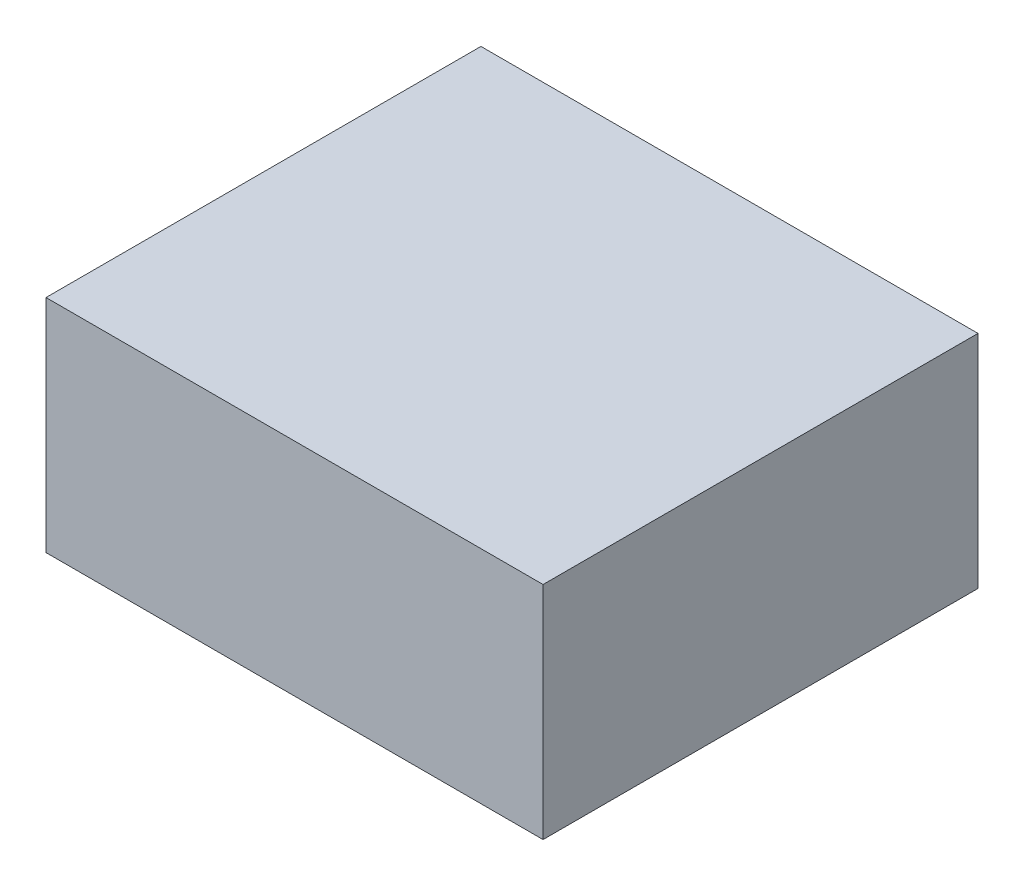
ISO-10303-21;
HEADER;
FILE_DESCRIPTION(('STEP AP214'),'2;1');
FILE_NAME('part.step','',(''),(''),'','','');
FILE_SCHEMA(('AUTOMOTIVE_DESIGN { 1 0 10303 214 1 1 1 1 }'));
ENDSEC;
DATA;
#1=APPLICATION_CONTEXT('core data for automotive mechanical design processes');
#2=APPLICATION_PROTOCOL_DEFINITION('international standard','automotive_design',2000,#1);
#3=PRODUCT_CONTEXT('',#1,'mechanical');
#4=PRODUCT('Part','Part','',(#3));
#5=PRODUCT_RELATED_PRODUCT_CATEGORY('part','',(#4));
#6=PRODUCT_DEFINITION_FORMATION('','',#4);
#7=PRODUCT_DEFINITION_CONTEXT('part definition',#1,'design');
#8=PRODUCT_DEFINITION('design','',#6,#7);
#9=PRODUCT_DEFINITION_SHAPE('','',#8);
#10=(LENGTH_UNIT() NAMED_UNIT(*) SI_UNIT(.MILLI.,.METRE.));
#11=(NAMED_UNIT(*) PLANE_ANGLE_UNIT() SI_UNIT($,.RADIAN.));
#12=(NAMED_UNIT(*) SI_UNIT($,.STERADIAN.) SOLID_ANGLE_UNIT());
#13=UNCERTAINTY_MEASURE_WITH_UNIT(LENGTH_MEASURE(1.E-05),#10,'distance_accuracy_value','');
#14=(GEOMETRIC_REPRESENTATION_CONTEXT(3) GLOBAL_UNCERTAINTY_ASSIGNED_CONTEXT((#13)) GLOBAL_UNIT_ASSIGNED_CONTEXT((#10,
#11,#12)) REPRESENTATION_CONTEXT('',''));
#15=CARTESIAN_POINT('',(0.,0.,0.));
#16=DIRECTION('',(0.,0.,1.));
#17=DIRECTION('',(1.,0.,0.));
#18=AXIS2_PLACEMENT_3D('',#15,#16,#17);
#19=CARTESIAN_POINT('',(18.,-61.,-15.75));
#20=DIRECTION('',(1.,0.,0.));
#21=DIRECTION('',(0.,0.,-1.));
#22=AXIS2_PLACEMENT_3D('',#19,#20,#21);
#23=PLANE('',#22);
#24=DIRECTION('',(0.,1.,0.));
#25=VECTOR('',#24,1.);
#26=CARTESIAN_POINT('',(18.,-61.,15.75));
#27=LINE('',#26,#25);
#28=CARTESIAN_POINT('',(18.,-61.,15.75));
#29=VERTEX_POINT('',#28);
#30=CARTESIAN_POINT('',(18.,-45.,15.75));
#31=VERTEX_POINT('',#30);
#32=EDGE_CURVE('E105',#29,#31,#27,.T.);
#33=ORIENTED_EDGE('',*,*,#32,.F.);
#34=DIRECTION('',(0.,0.,1.));
#35=VECTOR('',#34,1.);
#36=CARTESIAN_POINT('',(18.,-61.,-15.75));
#37=LINE('',#36,#35);
#38=CARTESIAN_POINT('',(18.,-61.,-15.75));
#39=VERTEX_POINT('',#38);
#40=EDGE_CURVE('E11',#39,#29,#37,.T.);
#41=ORIENTED_EDGE('',*,*,#40,.F.);
#42=DIRECTION('',(0.,1.,0.));
#43=VECTOR('',#42,1.);
#44=CARTESIAN_POINT('',(18.,-61.,-15.75));
#45=LINE('',#44,#43);
#46=CARTESIAN_POINT('',(18.,-45.,-15.75));
#47=VERTEX_POINT('',#46);
#48=EDGE_CURVE('E99',#39,#47,#45,.T.);
#49=ORIENTED_EDGE('',*,*,#48,.T.);
#50=DIRECTION('',(0.,0.,1.));
#51=VECTOR('',#50,1.);
#52=CARTESIAN_POINT('',(18.,-45.,-15.75));
#53=LINE('',#52,#51);
#54=EDGE_CURVE('E44',#47,#31,#53,.T.);
#55=ORIENTED_EDGE('',*,*,#54,.T.);
#56=EDGE_LOOP('',(#33,#41,#49,#55));
#57=FACE_BOUND('',#56,.T.);
#58=ADVANCED_FACE('F41',(#57),#23,.T.);
#59=CARTESIAN_POINT('',(-18.,-61.,-15.75));
#60=DIRECTION('',(0.,-1.,0.));
#61=DIRECTION('',(0.,0.,-1.));
#62=AXIS2_PLACEMENT_3D('',#59,#60,#61);
#63=PLANE('',#62);
#64=DIRECTION('',(1.,0.,0.));
#65=VECTOR('',#64,1.);
#66=CARTESIAN_POINT('',(-18.,-61.,15.75));
#67=LINE('',#66,#65);
#68=CARTESIAN_POINT('',(-18.,-61.,15.75));
#69=VERTEX_POINT('',#68);
#70=EDGE_CURVE('E101',#69,#29,#67,.T.);
#71=ORIENTED_EDGE('',*,*,#70,.F.);
#72=DIRECTION('',(0.,0.,1.));
#73=VECTOR('',#72,1.);
#74=CARTESIAN_POINT('',(-18.,-61.,-15.75));
#75=LINE('',#74,#73);
#76=CARTESIAN_POINT('',(-18.,-61.,-15.75));
#77=VERTEX_POINT('',#76);
#78=EDGE_CURVE('E50',#77,#69,#75,.T.);
#79=ORIENTED_EDGE('',*,*,#78,.F.);
#80=DIRECTION('',(1.,0.,0.));
#81=VECTOR('',#80,1.);
#82=CARTESIAN_POINT('',(-18.,-61.,-15.75));
#83=LINE('',#82,#81);
#84=EDGE_CURVE('E96',#77,#39,#83,.T.);
#85=ORIENTED_EDGE('',*,*,#84,.T.);
#86=ORIENTED_EDGE('',*,*,#40,.T.);
#87=EDGE_LOOP('',(#71,#79,#85,#86));
#88=FACE_BOUND('',#87,.T.);
#89=ADVANCED_FACE('F115',(#88),#63,.T.);
#90=CARTESIAN_POINT('',(-18.,-61.,-15.75));
#91=DIRECTION('',(-1.,0.,0.));
#92=DIRECTION('',(0.,0.,1.));
#93=AXIS2_PLACEMENT_3D('',#90,#91,#92);
#94=PLANE('',#93);
#95=DIRECTION('',(0.,-1.,0.));
#96=VECTOR('',#95,1.);
#97=CARTESIAN_POINT('',(-18.,-61.,15.75));
#98=LINE('',#97,#96);
#99=CARTESIAN_POINT('',(-18.,-45.,15.75));
#100=VERTEX_POINT('',#99);
#101=EDGE_CURVE('E91',#100,#69,#98,.T.);
#102=ORIENTED_EDGE('',*,*,#101,.F.);
#103=DIRECTION('',(0.,0.,1.));
#104=VECTOR('',#103,1.);
#105=CARTESIAN_POINT('',(-18.,-45.,-15.75));
#106=LINE('',#105,#104);
#107=CARTESIAN_POINT('',(-18.,-45.,-15.75));
#108=VERTEX_POINT('',#107);
#109=EDGE_CURVE('E86',#108,#100,#106,.T.);
#110=ORIENTED_EDGE('',*,*,#109,.F.);
#111=DIRECTION('',(0.,-1.,0.));
#112=VECTOR('',#111,1.);
#113=CARTESIAN_POINT('',(-18.,-61.,-15.75));
#114=LINE('',#113,#112);
#115=EDGE_CURVE('E89',#108,#77,#114,.T.);
#116=ORIENTED_EDGE('',*,*,#115,.T.);
#117=ORIENTED_EDGE('',*,*,#78,.T.);
#118=EDGE_LOOP('',(#102,#110,#116,#117));
#119=FACE_BOUND('',#118,.T.);
#120=ADVANCED_FACE('F88',(#119),#94,.T.);
#121=CARTESIAN_POINT('',(-18.,-45.,-15.75));
#122=DIRECTION('',(0.,1.,0.));
#123=DIRECTION('',(0.,0.,1.));
#124=AXIS2_PLACEMENT_3D('',#121,#122,#123);
#125=PLANE('',#124);
#126=DIRECTION('',(-1.,0.,0.));
#127=VECTOR('',#126,1.);
#128=CARTESIAN_POINT('',(-18.,-45.,15.75));
#129=LINE('',#128,#127);
#130=EDGE_CURVE('E108',#31,#100,#129,.T.);
#131=ORIENTED_EDGE('',*,*,#130,.F.);
#132=ORIENTED_EDGE('',*,*,#54,.F.);
#133=DIRECTION('',(-1.,0.,0.));
#134=VECTOR('',#133,1.);
#135=CARTESIAN_POINT('',(-18.,-45.,-15.75));
#136=LINE('',#135,#134);
#137=EDGE_CURVE('E95',#47,#108,#136,.T.);
#138=ORIENTED_EDGE('',*,*,#137,.T.);
#139=ORIENTED_EDGE('',*,*,#109,.T.);
#140=EDGE_LOOP('',(#131,#132,#138,#139));
#141=FACE_BOUND('',#140,.T.);
#142=ADVANCED_FACE('F98',(#141),#125,.T.);
#143=CARTESIAN_POINT('',(0.,0.,-15.75));
#144=DIRECTION('',(0.,0.,-1.));
#145=DIRECTION('',(-1.,0.,0.));
#146=AXIS2_PLACEMENT_3D('',#143,#144,#145);
#147=PLANE('',#146);
#148=ORIENTED_EDGE('',*,*,#48,.F.);
#149=ORIENTED_EDGE('',*,*,#84,.F.);
#150=ORIENTED_EDGE('',*,*,#115,.F.);
#151=ORIENTED_EDGE('',*,*,#137,.F.);
#152=EDGE_LOOP('',(#148,#149,#150,#151));
#153=FACE_BOUND('',#152,.T.);
#154=ADVANCED_FACE('F94',(#153),#147,.T.);
#155=CARTESIAN_POINT('',(0.,0.,15.75));
#156=DIRECTION('',(0.,0.,-1.));
#157=DIRECTION('',(-1.,0.,0.));
#158=AXIS2_PLACEMENT_3D('',#155,#156,#157);
#159=PLANE('',#158);
#160=ORIENTED_EDGE('',*,*,#32,.T.);
#161=ORIENTED_EDGE('',*,*,#130,.T.);
#162=ORIENTED_EDGE('',*,*,#101,.T.);
#163=ORIENTED_EDGE('',*,*,#70,.T.);
#164=EDGE_LOOP('',(#160,#161,#162,#163));
#165=FACE_BOUND('',#164,.T.);
#166=ADVANCED_FACE('F114',(#165),#159,.F.);
#167=CLOSED_SHELL('',(#58,#89,#120,#142,#154,#166));
#168=MANIFOLD_SOLID_BREP('B2',#167);
#169=ADVANCED_BREP_SHAPE_REPRESENTATION('',(#18,#168),#14);
#170=SHAPE_DEFINITION_REPRESENTATION(#9,#169);
ENDSEC;
END-ISO-10303-21;
